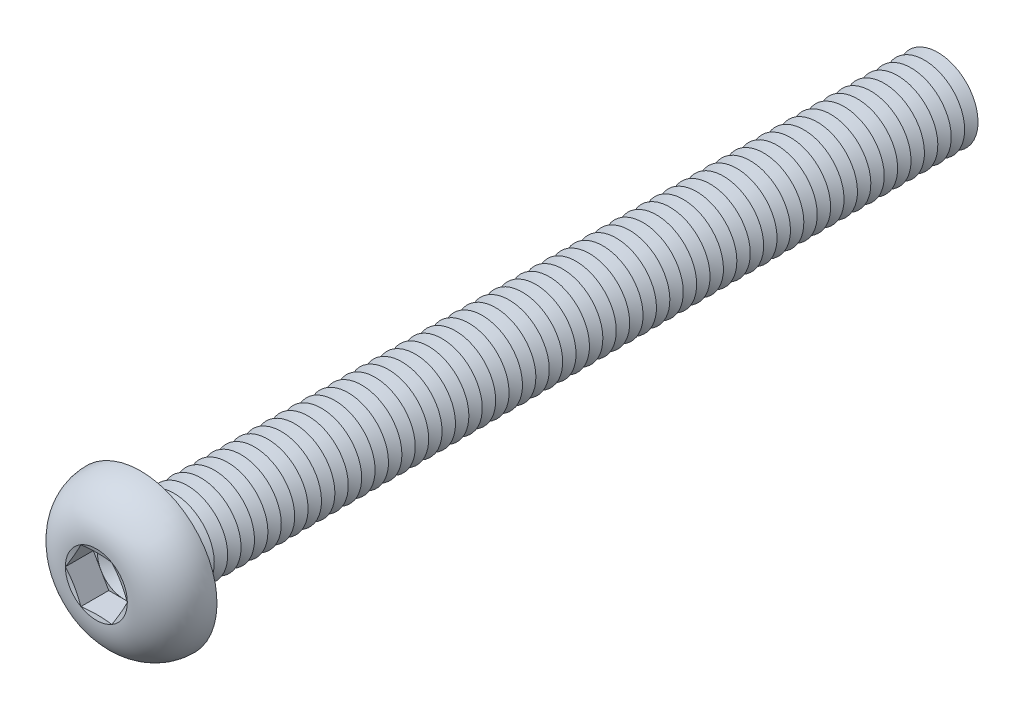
from build123d import *

# Parameters (mm, degrees)
FILLET1_R          = 0.25
LPATTERN1_COUNT    = 60
LPATTERN1_PITCH    = 0.5
CUT_EXTRUDE1_DEPTH = 1.04


with BuildPart() as part:
    # Sketch1 → Revolve1 (revolve)
    with BuildSketch(Plane(origin=(0, 0, 0), x_dir=(0, 0, -1), z_dir=(1, 0, 0))):
        with BuildLine():
            Line((0, 1.5), (0, 2.85))
            ThreePointArc((0, 2.85), (-1.182850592, 2.35063849), (-1.65, 1.1547))
            Line((-1.65, 1.1547), (-1.495299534, 0.57735))
            Line((-1.495299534, 0.57735), (-1.65, 0.57735))
            Line((-1.65, 0.57735), (-1.65, 0))
            Line((-1.65, 0), (30, 0))
            Line((30, 0), (30, 1.5))
            Line((30, 1.5), (0, 1.5))
        make_face()
    revolve(axis=Axis((0, 0, -30), (0, 0, 1)))

    # Fillet1
    fillet1_edges = [part.edges().sort_by_distance(p)[0] for p in [
        (0, -1.5, 0),
    ]]
    fillet(fillet1_edges, radius=FILLET1_R)

    # Sketch2 → Cut-Revolve1 (revolve, cut)
    with BuildSketch(Plane(origin=(0, 0, 0), x_dir=(0, 0, -1), z_dir=(1, 0, 0))):
        Polygon((29.75, 1.5), (30.25, 1.5), (30, 1.066987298), align=None)
    cut_revolve1 = revolve(axis=Axis((0, 0, -30), (0, 0, -1)), mode=Mode.SUBTRACT)

    # LPattern1: Cut-Revolve1 ×60
    with Locations(*[(0, 0, i * LPATTERN1_PITCH) for i in range(1, LPATTERN1_COUNT)]):
        add(cut_revolve1, mode=Mode.SUBTRACT)

    # Sketch3 → Cut-Extrude1 (cut)
    with BuildSketch(Plane.XY.offset(1.65)):
        Polygon((0.57735, 0.999999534), (-0.57735, 0.999999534), (-1.1547, 0), (-0.57735, -0.999999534), (0.57735, -0.999999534), (1.1547, 0), align=None)
    extrude(amount=-CUT_EXTRUDE1_DEPTH, mode=Mode.SUBTRACT)

    # Cut-Extrude2 cone 1 section (on through the dimple's axis) → Cut-Extrude2 (revolve, cut)
    with BuildSketch(Plane(origin=(0, 0, 0.61), x_dir=(0, -1, 0), z_dir=(1, 0, 0))):
        Polygon((0, 0), (0.999999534, 0), (0, 0.57735), align=None)
    revolve(axis=Axis((0, 0, 0.61), (0, 0, -1)), mode=Mode.SUBTRACT)


solid = part.part
